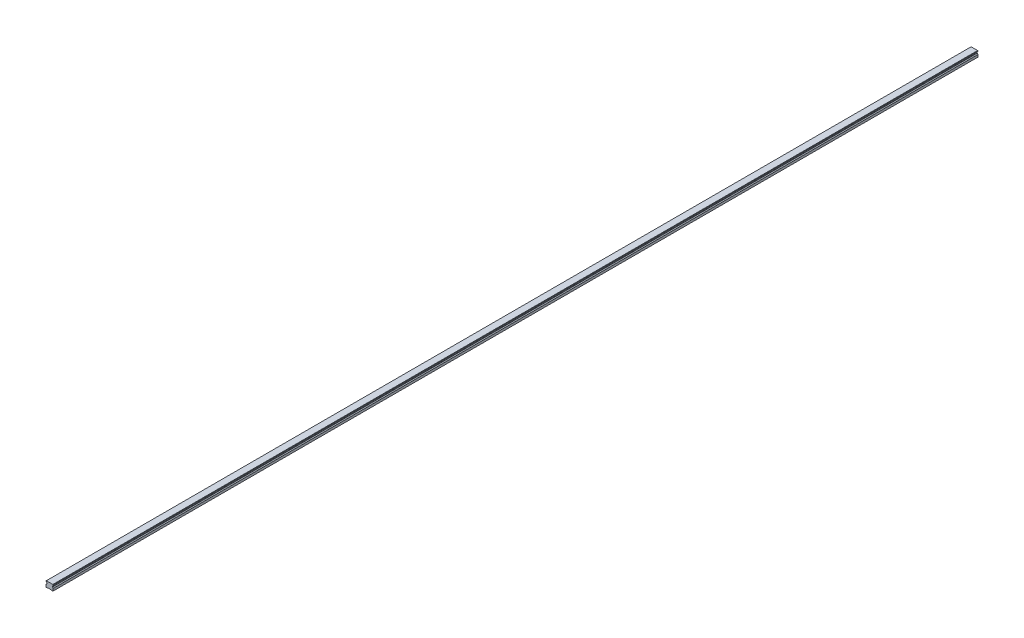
from build123d import *

# Parameters (mm, degrees)
SKETCH1_W           = 20
SKETCH1_H           = 16.3
BOSS_EXTRUDE1_DEPTH = 1280
CUT_EXTRUDE1_DEPTH  = 2561.071422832
CHAMFER1_SIZE       = 1
FILLET1_R           = 1
CUT_EXTRUDE2_DEPTH  = 2561.071422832
SKETCH5_R           = 3
SKETCH5_R_2         = 2.5
CUT_EXTRUDE5_DEPTH  = 10
SKETCH5_2_R         = 2.5
CUT_EXTRUDE6_DEPTH  = 13
LPATTERN2_COUNT     = 43
LPATTERN2_PITCH     = 60


with BuildPart() as part:
    # Sketch1 → Boss-Extrude1 (new, symmetric)
    with BuildSketch(Plane.XY):
        with Locations((0, 8.15)):
            Rectangle(SKETCH1_W, SKETCH1_H)
    extrude(amount=BOSS_EXTRUDE1_DEPTH, both=True)

    # Sketch2 → Cut-Extrude1 (cut, through all)
    with BuildSketch(Plane.XY.offset(1280)):
        Polygon((-10, 14.3), (-10, 7.3), (-7.666666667, 9.633333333), (-7.666666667, 11.966666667), align=None)
        Polygon((7.666666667, 11.966666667), (10, 14.3), (10, 7.3), (7.666666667, 9.633333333), align=None)
    extrude(amount=-CUT_EXTRUDE1_DEPTH, mode=Mode.SUBTRACT)

    # Chamfer1
    chamfer1_edges = [part.edges().sort_by_distance(p)[0] for p in [
        (-10, 16.3, 0),
        (10, 16.3, 0),
        (10, 0, 0),
        (-10, 0, 0),
    ]]
    chamfer(chamfer1_edges, length=CHAMFER1_SIZE)

    # Fillet1
    fillet1_edges = [part.edges().sort_by_distance(p)[0] for p in [
        (-7.666666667, 11.966666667, 0),
        (-7.666666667, 9.633333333, 0),
        (7.666666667, 9.633333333, 0),
        (7.666666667, 11.966666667, 0),
    ]]
    fillet(fillet1_edges, radius=FILLET1_R)

    # Sketch3 → Cut-Extrude2 (cut, through all)
    with BuildSketch(Plane.XY.offset(1280)):
        Polygon((-6, 0), (-5, 1), (5, 1), (6, 0), align=None)
    extrude(amount=-CUT_EXTRUDE2_DEPTH, mode=Mode.SUBTRACT)

    # Sketch5 → Cut-Extrude5 (cut)
    with BuildSketch(Plane.XZ.offset(-1)):
        with Locations(Location((0, 1260, 0), (0, 0, 270))):
            Circle(SKETCH5_R)
        with Locations(Location((0, 1260, 0), (0, 0, 270))):
            Circle(SKETCH5_R_2, mode=Mode.SUBTRACT)
    cut_extrude5 = extrude(amount=-CUT_EXTRUDE5_DEPTH, mode=Mode.SUBTRACT)

    # Sketch5_2 → Cut-Extrude6 (cut)
    with BuildSketch(Plane.XZ.offset(-1)):
        with Locations(Location((0, 1260, 0), (0, 0, 270))):
            Circle(SKETCH5_2_R)
    cut_extrude6 = extrude(amount=-CUT_EXTRUDE6_DEPTH, mode=Mode.SUBTRACT)

    # Cut-Extrude7 cone 1 section (on through the dimple's axis) → Cut-Extrude7 (revolve, cut)
    with BuildSketch(Plane(origin=(0, 14, 1260), x_dir=(0, 0, -1), z_dir=(1, 0, 0))):
        Polygon((0, 0), (2.5, 0), (0, 1.443375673), align=None)
    cut_extrude7 = revolve(axis=Axis((0, 14, 1260), (0, 1, 0)), mode=Mode.SUBTRACT)

    # LPattern2: Cut-Extrude5, Cut-Extrude6, Cut-Extrude7 ×43
    with Locations(*[(0, 0, -i * LPATTERN2_PITCH) for i in range(1, LPATTERN2_COUNT)]):
        add(cut_extrude5, mode=Mode.SUBTRACT)
        add(cut_extrude6, mode=Mode.SUBTRACT)
        add(cut_extrude7, mode=Mode.SUBTRACT)


solid = part.part
